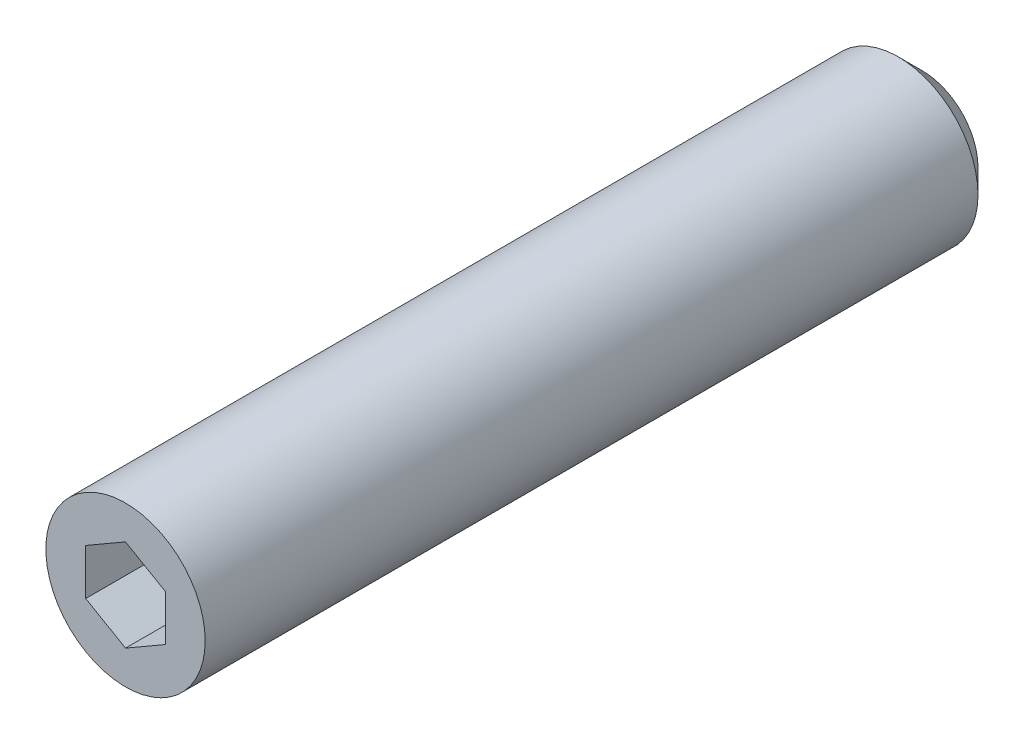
ISO-10303-21;
HEADER;
FILE_DESCRIPTION(('STEP AP214'),'2;1');
FILE_NAME('part.step','',(''),(''),'','','');
FILE_SCHEMA(('AUTOMOTIVE_DESIGN { 1 0 10303 214 1 1 1 1 }'));
ENDSEC;
DATA;
#1=APPLICATION_CONTEXT('core data for automotive mechanical design processes');
#2=APPLICATION_PROTOCOL_DEFINITION('international standard','automotive_design',2000,#1);
#3=PRODUCT_CONTEXT('',#1,'mechanical');
#4=PRODUCT('Part','Part','',(#3));
#5=PRODUCT_RELATED_PRODUCT_CATEGORY('part','',(#4));
#6=PRODUCT_DEFINITION_FORMATION('','',#4);
#7=PRODUCT_DEFINITION_CONTEXT('part definition',#1,'design');
#8=PRODUCT_DEFINITION('design','',#6,#7);
#9=PRODUCT_DEFINITION_SHAPE('','',#8);
#10=(LENGTH_UNIT() NAMED_UNIT(*) SI_UNIT(.MILLI.,.METRE.));
#11=(NAMED_UNIT(*) PLANE_ANGLE_UNIT() SI_UNIT($,.RADIAN.));
#12=(NAMED_UNIT(*) SI_UNIT($,.STERADIAN.) SOLID_ANGLE_UNIT());
#13=UNCERTAINTY_MEASURE_WITH_UNIT(LENGTH_MEASURE(1.E-05),#10,'distance_accuracy_value','');
#14=(GEOMETRIC_REPRESENTATION_CONTEXT(3) GLOBAL_UNCERTAINTY_ASSIGNED_CONTEXT((#13)) GLOBAL_UNIT_ASSIGNED_CONTEXT((#10,
#11,#12)) REPRESENTATION_CONTEXT('',''));
#15=CARTESIAN_POINT('',(0.,0.,0.));
#16=DIRECTION('',(0.,0.,1.));
#17=DIRECTION('',(1.,0.,0.));
#18=AXIS2_PLACEMENT_3D('',#15,#16,#17);
#19=CARTESIAN_POINT('',(0.,2.88675134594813,46.));
#20=DIRECTION('',(-0.5,-0.866025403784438,0.));
#21=DIRECTION('',(0.866025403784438,-0.5,0.));
#22=AXIS2_PLACEMENT_3D('',#19,#20,#21);
#23=PLANE('',#22);
#24=DIRECTION('',(0.,0.,1.));
#25=VECTOR('',#24,1.);
#26=CARTESIAN_POINT('',(2.5,1.44337567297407,46.));
#27=LINE('',#26,#25);
#28=CARTESIAN_POINT('',(2.5,1.44337567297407,46.));
#29=VERTEX_POINT('',#28);
#30=CARTESIAN_POINT('',(2.5,1.44337567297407,50.));
#31=VERTEX_POINT('',#30);
#32=EDGE_CURVE('E63',#29,#31,#27,.T.);
#33=ORIENTED_EDGE('',*,*,#32,.T.);
#34=DIRECTION('',(0.866025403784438,-0.5,0.));
#35=VECTOR('',#34,1.);
#36=CARTESIAN_POINT('',(0.,2.88675134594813,50.));
#37=LINE('',#36,#35);
#38=CARTESIAN_POINT('',(0.,2.88675134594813,50.));
#39=VERTEX_POINT('',#38);
#40=EDGE_CURVE('E29',#39,#31,#37,.T.);
#41=ORIENTED_EDGE('',*,*,#40,.F.);
#42=DIRECTION('',(0.,0.,1.));
#43=VECTOR('',#42,1.);
#44=CARTESIAN_POINT('',(0.,2.88675134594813,46.));
#45=LINE('',#44,#43);
#46=CARTESIAN_POINT('',(0.,2.88675134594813,46.));
#47=VERTEX_POINT('',#46);
#48=EDGE_CURVE('E33',#47,#39,#45,.T.);
#49=ORIENTED_EDGE('',*,*,#48,.F.);
#50=DIRECTION('',(0.866025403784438,-0.5,0.));
#51=VECTOR('',#50,1.);
#52=CARTESIAN_POINT('',(0.,2.88675134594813,46.));
#53=LINE('',#52,#51);
#54=EDGE_CURVE('E65',#47,#29,#53,.T.);
#55=ORIENTED_EDGE('',*,*,#54,.T.);
#56=EDGE_LOOP('',(#33,#41,#49,#55));
#57=FACE_BOUND('',#56,.T.);
#58=ADVANCED_FACE('F14',(#57),#23,.T.);
#59=CARTESIAN_POINT('',(2.5,1.44337567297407,46.));
#60=DIRECTION('',(-1.,0.,0.));
#61=DIRECTION('',(0.,-1.,0.));
#62=AXIS2_PLACEMENT_3D('',#59,#60,#61);
#63=PLANE('',#62);
#64=DIRECTION('',(0.,0.,1.));
#65=VECTOR('',#64,1.);
#66=CARTESIAN_POINT('',(2.5,-1.44337567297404,46.));
#67=LINE('',#66,#65);
#68=CARTESIAN_POINT('',(2.5,-1.44337567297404,46.));
#69=VERTEX_POINT('',#68);
#70=CARTESIAN_POINT('',(2.5,-1.44337567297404,50.));
#71=VERTEX_POINT('',#70);
#72=EDGE_CURVE('E70',#69,#71,#67,.T.);
#73=ORIENTED_EDGE('',*,*,#72,.T.);
#74=DIRECTION('',(0.,-1.,0.));
#75=VECTOR('',#74,1.);
#76=CARTESIAN_POINT('',(2.5,1.44337567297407,50.));
#77=LINE('',#76,#75);
#78=EDGE_CURVE('E73',#31,#71,#77,.T.);
#79=ORIENTED_EDGE('',*,*,#78,.F.);
#80=ORIENTED_EDGE('',*,*,#32,.F.);
#81=DIRECTION('',(0.,-1.,0.));
#82=VECTOR('',#81,1.);
#83=CARTESIAN_POINT('',(2.5,1.44337567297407,46.));
#84=LINE('',#83,#82);
#85=EDGE_CURVE('E100',#29,#69,#84,.T.);
#86=ORIENTED_EDGE('',*,*,#85,.T.);
#87=EDGE_LOOP('',(#73,#79,#80,#86));
#88=FACE_BOUND('',#87,.T.);
#89=ADVANCED_FACE('F74',(#88),#63,.T.);
#90=CARTESIAN_POINT('',(0.,-2.88675134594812,46.));
#91=DIRECTION('',(0.5,-0.866025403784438,0.));
#92=DIRECTION('',(0.866025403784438,0.5,0.));
#93=AXIS2_PLACEMENT_3D('',#90,#91,#92);
#94=PLANE('',#93);
#95=DIRECTION('',(0.,0.,1.));
#96=VECTOR('',#95,1.);
#97=CARTESIAN_POINT('',(0.,-2.88675134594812,46.));
#98=LINE('',#97,#96);
#99=CARTESIAN_POINT('',(0.,-2.88675134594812,46.));
#100=VERTEX_POINT('',#99);
#101=CARTESIAN_POINT('',(0.,-2.88675134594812,50.));
#102=VERTEX_POINT('',#101);
#103=EDGE_CURVE('E108',#100,#102,#98,.T.);
#104=ORIENTED_EDGE('',*,*,#103,.T.);
#105=DIRECTION('',(0.866025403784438,0.5,0.));
#106=VECTOR('',#105,1.);
#107=CARTESIAN_POINT('',(0.,-2.88675134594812,50.));
#108=LINE('',#107,#106);
#109=EDGE_CURVE('E78',#102,#71,#108,.T.);
#110=ORIENTED_EDGE('',*,*,#109,.T.);
#111=ORIENTED_EDGE('',*,*,#72,.F.);
#112=DIRECTION('',(0.866025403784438,0.5,0.));
#113=VECTOR('',#112,1.);
#114=CARTESIAN_POINT('',(0.,-2.88675134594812,46.));
#115=LINE('',#114,#113);
#116=EDGE_CURVE('E97',#100,#69,#115,.T.);
#117=ORIENTED_EDGE('',*,*,#116,.F.);
#118=EDGE_LOOP('',(#104,#110,#111,#117));
#119=FACE_BOUND('',#118,.T.);
#120=ADVANCED_FACE('F135',(#119),#94,.F.);
#121=CARTESIAN_POINT('',(0.,-2.88675134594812,46.));
#122=DIRECTION('',(0.5,0.866025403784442,0.));
#123=DIRECTION('',(-0.866025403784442,0.5,0.));
#124=AXIS2_PLACEMENT_3D('',#121,#122,#123);
#125=PLANE('',#124);
#126=DIRECTION('',(0.,0.,1.));
#127=VECTOR('',#126,1.);
#128=CARTESIAN_POINT('',(-2.49999999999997,-1.44337567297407,46.));
#129=LINE('',#128,#127);
#130=CARTESIAN_POINT('',(-2.49999999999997,-1.44337567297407,46.));
#131=VERTEX_POINT('',#130);
#132=CARTESIAN_POINT('',(-2.49999999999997,-1.44337567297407,50.));
#133=VERTEX_POINT('',#132);
#134=EDGE_CURVE('E106',#131,#133,#129,.T.);
#135=ORIENTED_EDGE('',*,*,#134,.T.);
#136=DIRECTION('',(-0.866025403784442,0.5,0.));
#137=VECTOR('',#136,1.);
#138=CARTESIAN_POINT('',(0.,-2.88675134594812,50.));
#139=LINE('',#138,#137);
#140=EDGE_CURVE('E173',#102,#133,#139,.T.);
#141=ORIENTED_EDGE('',*,*,#140,.F.);
#142=ORIENTED_EDGE('',*,*,#103,.F.);
#143=DIRECTION('',(-0.866025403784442,0.5,0.));
#144=VECTOR('',#143,1.);
#145=CARTESIAN_POINT('',(0.,-2.88675134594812,46.));
#146=LINE('',#145,#144);
#147=EDGE_CURVE('E94',#100,#131,#146,.T.);
#148=ORIENTED_EDGE('',*,*,#147,.T.);
#149=EDGE_LOOP('',(#135,#141,#142,#148));
#150=FACE_BOUND('',#149,.T.);
#151=ADVANCED_FACE('F147',(#150),#125,.T.);
#152=CARTESIAN_POINT('',(-2.49999999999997,1.44337567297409,46.));
#153=DIRECTION('',(-1.,0.,0.));
#154=DIRECTION('',(0.,-1.,0.));
#155=AXIS2_PLACEMENT_3D('',#152,#153,#154);
#156=PLANE('',#155);
#157=DIRECTION('',(0.,0.,1.));
#158=VECTOR('',#157,1.);
#159=CARTESIAN_POINT('',(-2.49999999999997,1.44337567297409,46.));
#160=LINE('',#159,#158);
#161=CARTESIAN_POINT('',(-2.49999999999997,1.44337567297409,46.));
#162=VERTEX_POINT('',#161);
#163=CARTESIAN_POINT('',(-2.49999999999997,1.44337567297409,50.));
#164=VERTEX_POINT('',#163);
#165=EDGE_CURVE('E104',#162,#164,#160,.T.);
#166=ORIENTED_EDGE('',*,*,#165,.T.);
#167=DIRECTION('',(0.,-1.,0.));
#168=VECTOR('',#167,1.);
#169=CARTESIAN_POINT('',(-2.49999999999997,1.44337567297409,50.));
#170=LINE('',#169,#168);
#171=EDGE_CURVE('E174',#164,#133,#170,.T.);
#172=ORIENTED_EDGE('',*,*,#171,.T.);
#173=ORIENTED_EDGE('',*,*,#134,.F.);
#174=DIRECTION('',(0.,-1.,0.));
#175=VECTOR('',#174,1.);
#176=CARTESIAN_POINT('',(-2.49999999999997,1.44337567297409,46.));
#177=LINE('',#176,#175);
#178=EDGE_CURVE('E91',#162,#131,#177,.T.);
#179=ORIENTED_EDGE('',*,*,#178,.F.);
#180=EDGE_LOOP('',(#166,#172,#173,#179));
#181=FACE_BOUND('',#180,.T.);
#182=ADVANCED_FACE('F143',(#181),#156,.F.);
#183=CARTESIAN_POINT('',(0.,2.88675134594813,46.));
#184=DIRECTION('',(-0.499999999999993,0.866025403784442,0.));
#185=DIRECTION('',(-0.866025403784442,-0.499999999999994,0.));
#186=AXIS2_PLACEMENT_3D('',#183,#184,#185);
#187=PLANE('',#186);
#188=DIRECTION('',(-0.866025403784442,-0.499999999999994,0.));
#189=VECTOR('',#188,1.);
#190=CARTESIAN_POINT('',(0.,2.88675134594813,46.));
#191=LINE('',#190,#189);
#192=EDGE_CURVE('E88',#47,#162,#191,.T.);
#193=ORIENTED_EDGE('',*,*,#192,.F.);
#194=ORIENTED_EDGE('',*,*,#48,.T.);
#195=DIRECTION('',(-0.866025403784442,-0.499999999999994,0.));
#196=VECTOR('',#195,1.);
#197=CARTESIAN_POINT('',(0.,2.88675134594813,50.));
#198=LINE('',#197,#196);
#199=EDGE_CURVE('E84',#39,#164,#198,.T.);
#200=ORIENTED_EDGE('',*,*,#199,.T.);
#201=ORIENTED_EDGE('',*,*,#165,.F.);
#202=EDGE_LOOP('',(#193,#194,#200,#201));
#203=FACE_BOUND('',#202,.T.);
#204=ADVANCED_FACE('F140',(#203),#187,.F.);
#205=CARTESIAN_POINT('',(5.,0.,46.));
#206=DIRECTION('',(0.,0.,1.));
#207=DIRECTION('',(1.,0.,0.));
#208=AXIS2_PLACEMENT_3D('',#205,#206,#207);
#209=PLANE('',#208);
#210=ORIENTED_EDGE('',*,*,#54,.F.);
#211=ORIENTED_EDGE('',*,*,#192,.T.);
#212=ORIENTED_EDGE('',*,*,#178,.T.);
#213=ORIENTED_EDGE('',*,*,#147,.F.);
#214=ORIENTED_EDGE('',*,*,#116,.T.);
#215=ORIENTED_EDGE('',*,*,#85,.F.);
#216=EDGE_LOOP('',(#210,#211,#212,#213,#214,#215));
#217=FACE_BOUND('',#216,.T.);
#218=ADVANCED_FACE('F139',(#217),#209,.T.);
#219=CARTESIAN_POINT('',(5.,0.,50.));
#220=DIRECTION('',(0.,0.,-1.));
#221=DIRECTION('',(-1.,0.,0.));
#222=AXIS2_PLACEMENT_3D('',#219,#220,#221);
#223=PLANE('',#222);
#224=CARTESIAN_POINT('',(0.,0.,50.));
#225=DIRECTION('',(0.,0.,1.));
#226=DIRECTION('',(1.,0.,0.));
#227=AXIS2_PLACEMENT_3D('',#224,#225,#226);
#228=CIRCLE('',#227,5.);
#229=CARTESIAN_POINT('',(5.00000000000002,0.,50.));
#230=VERTEX_POINT('',#229);
#231=EDGE_CURVE('E69',#230,#230,#228,.T.);
#232=ORIENTED_EDGE('',*,*,#231,.T.);
#233=EDGE_LOOP('',(#232));
#234=FACE_BOUND('',#233,.T.);
#235=ORIENTED_EDGE('',*,*,#40,.T.);
#236=ORIENTED_EDGE('',*,*,#78,.T.);
#237=ORIENTED_EDGE('',*,*,#109,.F.);
#238=ORIENTED_EDGE('',*,*,#140,.T.);
#239=ORIENTED_EDGE('',*,*,#171,.F.);
#240=ORIENTED_EDGE('',*,*,#199,.F.);
#241=EDGE_LOOP('',(#235,#236,#237,#238,#239,#240));
#242=FACE_BOUND('',#241,.T.);
#243=ADVANCED_FACE('F81',(#234,#242),#223,.F.);
#244=CARTESIAN_POINT('',(0.,0.,0.));
#245=DIRECTION('',(0.,0.,1.));
#246=DIRECTION('',(1.,0.,0.));
#247=AXIS2_PLACEMENT_3D('',#244,#245,#246);
#248=PLANE('',#247);
#249=CARTESIAN_POINT('',(0.,0.,0.));
#250=DIRECTION('',(0.,0.,1.));
#251=DIRECTION('',(1.,0.,0.));
#252=AXIS2_PLACEMENT_3D('',#249,#250,#251);
#253=CIRCLE('',#252,3.5);
#254=CARTESIAN_POINT('',(3.5,0.,0.));
#255=VERTEX_POINT('',#254);
#256=EDGE_CURVE('E9',#255,#255,#253,.T.);
#257=ORIENTED_EDGE('',*,*,#256,.F.);
#258=EDGE_LOOP('',(#257));
#259=FACE_BOUND('',#258,.T.);
#260=ADVANCED_FACE('F16',(#259),#248,.F.);
#261=CARTESIAN_POINT('',(0.,0.,1.5));
#262=DIRECTION('',(0.,0.,1.));
#263=DIRECTION('',(1.,0.,0.));
#264=AXIS2_PLACEMENT_3D('',#261,#262,#263);
#265=CONICAL_SURFACE('',#264,5.,0.785398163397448);
#266=ORIENTED_EDGE('',*,*,#256,.T.);
#267=EDGE_LOOP('',(#266));
#268=FACE_BOUND('',#267,.T.);
#269=CARTESIAN_POINT('',(0.,0.,1.5));
#270=DIRECTION('',(0.,0.,1.));
#271=DIRECTION('',(1.,0.,0.));
#272=AXIS2_PLACEMENT_3D('',#269,#270,#271);
#273=CIRCLE('',#272,5.);
#274=CARTESIAN_POINT('',(5.,0.,1.5));
#275=VERTEX_POINT('',#274);
#276=EDGE_CURVE('E22',#275,#275,#273,.T.);
#277=ORIENTED_EDGE('',*,*,#276,.F.);
#278=EDGE_LOOP('',(#277));
#279=FACE_BOUND('',#278,.T.);
#280=ADVANCED_FACE('F117',(#268,#279),#265,.T.);
#281=CARTESIAN_POINT('',(0.,0.,110.));
#282=DIRECTION('',(0.,0.,1.));
#283=DIRECTION('',(1.,0.,0.));
#284=AXIS2_PLACEMENT_3D('',#281,#282,#283);
#285=CYLINDRICAL_SURFACE('',#284,5.);
#286=ORIENTED_EDGE('',*,*,#231,.F.);
#287=EDGE_LOOP('',(#286));
#288=FACE_BOUND('',#287,.T.);
#289=ORIENTED_EDGE('',*,*,#276,.T.);
#290=EDGE_LOOP('',(#289));
#291=FACE_BOUND('',#290,.T.);
#292=ADVANCED_FACE('F115',(#288,#291),#285,.T.);
#293=CLOSED_SHELL('',(#58,#89,#120,#151,#182,#204,#218,#243,#260,#280,#292));
#294=MANIFOLD_SOLID_BREP('B1',#293);
#295=ADVANCED_BREP_SHAPE_REPRESENTATION('',(#18,#294),#14);
#296=SHAPE_DEFINITION_REPRESENTATION(#9,#295);
ENDSEC;
END-ISO-10303-21;
